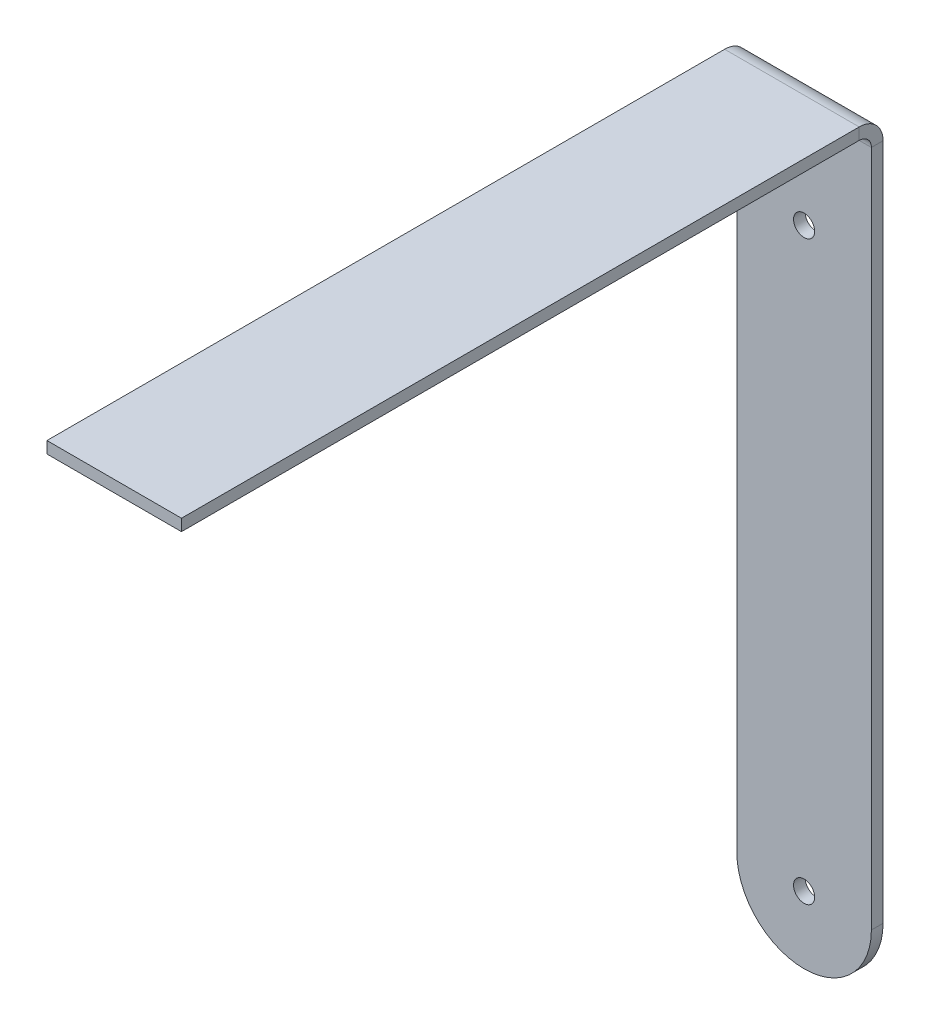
ISO-10303-21;
HEADER;
FILE_DESCRIPTION(('STEP AP214'),'2;1');
FILE_NAME('part.step','',(''),(''),'','','');
FILE_SCHEMA(('AUTOMOTIVE_DESIGN { 1 0 10303 214 1 1 1 1 }'));
ENDSEC;
DATA;
#1=APPLICATION_CONTEXT('core data for automotive mechanical design processes');
#2=APPLICATION_PROTOCOL_DEFINITION('international standard','automotive_design',2000,#1);
#3=PRODUCT_CONTEXT('',#1,'mechanical');
#4=PRODUCT('Part','Part','',(#3));
#5=PRODUCT_RELATED_PRODUCT_CATEGORY('part','',(#4));
#6=PRODUCT_DEFINITION_FORMATION('','',#4);
#7=PRODUCT_DEFINITION_CONTEXT('part definition',#1,'design');
#8=PRODUCT_DEFINITION('design','',#6,#7);
#9=PRODUCT_DEFINITION_SHAPE('','',#8);
#10=(LENGTH_UNIT() NAMED_UNIT(*) SI_UNIT(.MILLI.,.METRE.));
#11=(NAMED_UNIT(*) PLANE_ANGLE_UNIT() SI_UNIT($,.RADIAN.));
#12=(NAMED_UNIT(*) SI_UNIT($,.STERADIAN.) SOLID_ANGLE_UNIT());
#13=UNCERTAINTY_MEASURE_WITH_UNIT(LENGTH_MEASURE(1.E-05),#10,'distance_accuracy_value','');
#14=(GEOMETRIC_REPRESENTATION_CONTEXT(3) GLOBAL_UNCERTAINTY_ASSIGNED_CONTEXT((#13)) GLOBAL_UNIT_ASSIGNED_CONTEXT((#10,
#11,#12)) REPRESENTATION_CONTEXT('',''));
#15=CARTESIAN_POINT('',(0.,0.,0.));
#16=DIRECTION('',(0.,0.,1.));
#17=DIRECTION('',(1.,0.,0.));
#18=AXIS2_PLACEMENT_3D('',#15,#16,#17);
#19=CARTESIAN_POINT('',(17.5,-6.21284,0.));
#20=DIRECTION('',(1.,0.,0.));
#21=DIRECTION('',(0.,0.,-1.));
#22=AXIS2_PLACEMENT_3D('',#19,#20,#21);
#23=PLANE('',#22);
#24=DIRECTION('',(0.,0.,1.));
#25=VECTOR('',#24,1.);
#26=CARTESIAN_POINT('',(17.5,-6.21284,0.));
#27=LINE('',#26,#25);
#28=CARTESIAN_POINT('',(17.5,-6.21284,0.));
#29=VERTEX_POINT('',#28);
#30=CARTESIAN_POINT('',(17.5,-6.21284,3.03784));
#31=VERTEX_POINT('',#30);
#32=EDGE_CURVE('E11',#29,#31,#27,.T.);
#33=ORIENTED_EDGE('',*,*,#32,.F.);
#34=CARTESIAN_POINT('',(17.5,-6.21284,6.21284000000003));
#35=DIRECTION('',(1.,0.,0.));
#36=DIRECTION('',(0.,0.,-1.));
#37=AXIS2_PLACEMENT_3D('',#34,#35,#36);
#38=CIRCLE('',#37,6.21284);
#39=CARTESIAN_POINT('',(17.5,0.,6.21284000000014));
#40=VERTEX_POINT('',#39);
#41=EDGE_CURVE('E129',#40,#29,#38,.F.);
#42=ORIENTED_EDGE('',*,*,#41,.F.);
#43=DIRECTION('',(0.,1.,0.));
#44=VECTOR('',#43,1.);
#45=CARTESIAN_POINT('',(17.5,-3.03784,6.21284000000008));
#46=LINE('',#45,#44);
#47=CARTESIAN_POINT('',(17.5,-3.03784,6.21284000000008));
#48=VERTEX_POINT('',#47);
#49=EDGE_CURVE('E46',#48,#40,#46,.T.);
#50=ORIENTED_EDGE('',*,*,#49,.F.);
#51=CARTESIAN_POINT('',(17.5,-6.21284,6.21284000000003));
#52=DIRECTION('',(1.,0.,0.));
#53=DIRECTION('',(0.,0.,-1.));
#54=AXIS2_PLACEMENT_3D('',#51,#52,#53);
#55=CIRCLE('',#54,3.175);
#56=EDGE_CURVE('E122',#48,#31,#55,.F.);
#57=ORIENTED_EDGE('',*,*,#56,.T.);
#58=EDGE_LOOP('',(#33,#42,#50,#57));
#59=FACE_BOUND('',#58,.T.);
#60=ADVANCED_FACE('F38',(#59),#23,.T.);
#61=CARTESIAN_POINT('',(17.5,-3.03784,6.21284000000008));
#62=DIRECTION('',(1.,0.,0.));
#63=DIRECTION('',(0.,0.,-1.));
#64=AXIS2_PLACEMENT_3D('',#61,#62,#63);
#65=PLANE('',#64);
#66=DIRECTION('',(0.,-1.,0.));
#67=VECTOR('',#66,1.);
#68=CARTESIAN_POINT('',(17.5,0.,0.));
#69=LINE('',#68,#67);
#70=CARTESIAN_POINT('',(17.5,-182.5,0.));
#71=VERTEX_POINT('',#70);
#72=EDGE_CURVE('E173',#29,#71,#69,.T.);
#73=ORIENTED_EDGE('',*,*,#72,.F.);
#74=ORIENTED_EDGE('',*,*,#32,.T.);
#75=DIRECTION('',(0.,-1.,0.));
#76=VECTOR('',#75,1.);
#77=CARTESIAN_POINT('',(17.5,0.,3.03784));
#78=LINE('',#77,#76);
#79=CARTESIAN_POINT('',(17.5,-182.5,3.03783999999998));
#80=VERTEX_POINT('',#79);
#81=EDGE_CURVE('E154',#31,#80,#78,.T.);
#82=ORIENTED_EDGE('',*,*,#81,.T.);
#83=DIRECTION('',(0.,0.,1.));
#84=VECTOR('',#83,1.);
#85=CARTESIAN_POINT('',(17.5,-182.5,0.));
#86=LINE('',#85,#84);
#87=EDGE_CURVE('E374',#71,#80,#86,.T.);
#88=ORIENTED_EDGE('',*,*,#87,.F.);
#89=EDGE_LOOP('',(#73,#74,#82,#88));
#90=FACE_BOUND('',#89,.T.);
#91=ADVANCED_FACE('F181',(#90),#65,.T.);
#92=CARTESIAN_POINT('',(-17.5,0.,6.21284000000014));
#93=DIRECTION('',(-1.,0.,0.));
#94=DIRECTION('',(0.,0.,1.));
#95=AXIS2_PLACEMENT_3D('',#92,#93,#94);
#96=PLANE('',#95);
#97=DIRECTION('',(0.,-1.,0.));
#98=VECTOR('',#97,1.);
#99=CARTESIAN_POINT('',(-17.5,0.,6.21284000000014));
#100=LINE('',#99,#98);
#101=CARTESIAN_POINT('',(-17.5,0.,6.21284000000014));
#102=VERTEX_POINT('',#101);
#103=CARTESIAN_POINT('',(-17.5,-3.03784,6.21284000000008));
#104=VERTEX_POINT('',#103);
#105=EDGE_CURVE('E79',#102,#104,#100,.T.);
#106=ORIENTED_EDGE('',*,*,#105,.F.);
#107=CARTESIAN_POINT('',(-17.5,-6.21284,6.21284000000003));
#108=DIRECTION('',(1.,0.,0.));
#109=DIRECTION('',(0.,0.,-1.));
#110=AXIS2_PLACEMENT_3D('',#107,#108,#109);
#111=CIRCLE('',#110,6.21284);
#112=CARTESIAN_POINT('',(-17.5,-6.21284,0.));
#113=VERTEX_POINT('',#112);
#114=EDGE_CURVE('E145',#102,#113,#111,.F.);
#115=ORIENTED_EDGE('',*,*,#114,.T.);
#116=DIRECTION('',(0.,0.,-1.));
#117=VECTOR('',#116,1.);
#118=CARTESIAN_POINT('',(-17.5,-6.21284,3.03784));
#119=LINE('',#118,#117);
#120=CARTESIAN_POINT('',(-17.5,-6.21284,3.03784));
#121=VERTEX_POINT('',#120);
#122=EDGE_CURVE('E86',#121,#113,#119,.T.);
#123=ORIENTED_EDGE('',*,*,#122,.F.);
#124=CARTESIAN_POINT('',(-17.5,-6.21284,6.21284000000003));
#125=DIRECTION('',(1.,0.,0.));
#126=DIRECTION('',(0.,0.,-1.));
#127=AXIS2_PLACEMENT_3D('',#124,#125,#126);
#128=CIRCLE('',#127,3.175);
#129=EDGE_CURVE('E152',#104,#121,#128,.F.);
#130=ORIENTED_EDGE('',*,*,#129,.F.);
#131=EDGE_LOOP('',(#106,#115,#123,#130));
#132=FACE_BOUND('',#131,.T.);
#133=ADVANCED_FACE('F179',(#132),#96,.T.);
#134=CARTESIAN_POINT('',(-17.5,-6.21284,3.03784));
#135=DIRECTION('',(-1.,0.,0.));
#136=DIRECTION('',(0.,0.,1.));
#137=AXIS2_PLACEMENT_3D('',#134,#135,#136);
#138=PLANE('',#137);
#139=DIRECTION('',(0.,0.,-1.));
#140=VECTOR('',#139,1.);
#141=CARTESIAN_POINT('',(-17.5,0.,182.5));
#142=LINE('',#141,#140);
#143=CARTESIAN_POINT('',(-17.5,0.,182.5));
#144=VERTEX_POINT('',#143);
#145=EDGE_CURVE('E147',#144,#102,#142,.T.);
#146=ORIENTED_EDGE('',*,*,#145,.T.);
#147=ORIENTED_EDGE('',*,*,#105,.T.);
#148=DIRECTION('',(0.,0.,-1.));
#149=VECTOR('',#148,1.);
#150=CARTESIAN_POINT('',(-17.5,-3.03784,182.5));
#151=LINE('',#150,#149);
#152=CARTESIAN_POINT('',(-17.5,-3.03784,182.5));
#153=VERTEX_POINT('',#152);
#154=EDGE_CURVE('E150',#153,#104,#151,.T.);
#155=ORIENTED_EDGE('',*,*,#154,.F.);
#156=DIRECTION('',(0.,1.,0.));
#157=VECTOR('',#156,1.);
#158=CARTESIAN_POINT('',(-17.5,-3.03784,182.5));
#159=LINE('',#158,#157);
#160=EDGE_CURVE('E110',#153,#144,#159,.T.);
#161=ORIENTED_EDGE('',*,*,#160,.T.);
#162=EDGE_LOOP('',(#146,#147,#155,#161));
#163=FACE_BOUND('',#162,.T.);
#164=ADVANCED_FACE('F175',(#163),#138,.T.);
#165=CARTESIAN_POINT('',(17.5,0.,3.03784));
#166=DIRECTION('',(0.,0.,-1.));
#167=DIRECTION('',(0.,1.,0.));
#168=AXIS2_PLACEMENT_3D('',#165,#166,#167);
#169=PLANE('',#168);
#170=CARTESIAN_POINT('',(0.,-182.5,3.03783999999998));
#171=DIRECTION('',(0.,0.,-1.));
#172=DIRECTION('',(0.,1.,0.));
#173=AXIS2_PLACEMENT_3D('',#170,#171,#172);
#174=CIRCLE('',#173,2.75);
#175=CARTESIAN_POINT('',(0.,-179.75,3.03783999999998));
#176=VERTEX_POINT('',#175);
#177=EDGE_CURVE('E356',#176,#176,#174,.T.);
#178=ORIENTED_EDGE('',*,*,#177,.T.);
#179=EDGE_LOOP('',(#178));
#180=FACE_BOUND('',#179,.T.);
#181=CARTESIAN_POINT('',(0.,-32.5,3.03784));
#182=DIRECTION('',(0.,0.,-1.));
#183=DIRECTION('',(0.,1.,0.));
#184=AXIS2_PLACEMENT_3D('',#181,#182,#183);
#185=CIRCLE('',#184,2.75);
#186=CARTESIAN_POINT('',(0.,-29.75,3.03784));
#187=VERTEX_POINT('',#186);
#188=EDGE_CURVE('E366',#187,#187,#185,.T.);
#189=ORIENTED_EDGE('',*,*,#188,.T.);
#190=EDGE_LOOP('',(#189));
#191=FACE_BOUND('',#190,.T.);
#192=DIRECTION('',(0.,-1.,0.));
#193=VECTOR('',#192,1.);
#194=CARTESIAN_POINT('',(-17.5,0.,3.03784));
#195=LINE('',#194,#193);
#196=CARTESIAN_POINT('',(-17.5,-182.5,3.03783999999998));
#197=VERTEX_POINT('',#196);
#198=EDGE_CURVE('E135',#121,#197,#195,.T.);
#199=ORIENTED_EDGE('',*,*,#198,.T.);
#200=CARTESIAN_POINT('',(0.,-182.5,3.03783999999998));
#201=DIRECTION('',(0.,0.,-1.));
#202=DIRECTION('',(0.,1.,0.));
#203=AXIS2_PLACEMENT_3D('',#200,#201,#202);
#204=CIRCLE('',#203,17.5);
#205=EDGE_CURVE('E139',#80,#197,#204,.T.);
#206=ORIENTED_EDGE('',*,*,#205,.F.);
#207=ORIENTED_EDGE('',*,*,#81,.F.);
#208=DIRECTION('',(-1.,0.,0.));
#209=VECTOR('',#208,1.);
#210=CARTESIAN_POINT('',(17.5,-6.21284,3.03784));
#211=LINE('',#210,#209);
#212=EDGE_CURVE('E134',#31,#121,#211,.T.);
#213=ORIENTED_EDGE('',*,*,#212,.T.);
#214=EDGE_LOOP('',(#199,#206,#207,#213));
#215=FACE_BOUND('',#214,.T.);
#216=ADVANCED_FACE('F187',(#180,#191,#215),#169,.F.);
#217=CARTESIAN_POINT('',(17.5,0.,0.));
#218=DIRECTION('',(0.,0.,-1.));
#219=DIRECTION('',(0.,1.,0.));
#220=AXIS2_PLACEMENT_3D('',#217,#218,#219);
#221=PLANE('',#220);
#222=CARTESIAN_POINT('',(0.,-182.5,0.));
#223=DIRECTION('',(0.,0.,-1.));
#224=DIRECTION('',(0.,1.,0.));
#225=AXIS2_PLACEMENT_3D('',#222,#223,#224);
#226=CIRCLE('',#225,2.75);
#227=CARTESIAN_POINT('',(0.,-179.75,0.));
#228=VERTEX_POINT('',#227);
#229=EDGE_CURVE('E359',#228,#228,#226,.T.);
#230=ORIENTED_EDGE('',*,*,#229,.F.);
#231=EDGE_LOOP('',(#230));
#232=FACE_BOUND('',#231,.T.);
#233=CARTESIAN_POINT('',(0.,-32.5,0.));
#234=DIRECTION('',(0.,0.,-1.));
#235=DIRECTION('',(0.,1.,0.));
#236=AXIS2_PLACEMENT_3D('',#233,#234,#235);
#237=CIRCLE('',#236,2.75);
#238=CARTESIAN_POINT('',(0.,-29.75,0.));
#239=VERTEX_POINT('',#238);
#240=EDGE_CURVE('E361',#239,#239,#237,.T.);
#241=ORIENTED_EDGE('',*,*,#240,.F.);
#242=EDGE_LOOP('',(#241));
#243=FACE_BOUND('',#242,.T.);
#244=ORIENTED_EDGE('',*,*,#72,.T.);
#245=CARTESIAN_POINT('',(0.,-182.5,0.));
#246=DIRECTION('',(0.,0.,-1.));
#247=DIRECTION('',(0.,1.,0.));
#248=AXIS2_PLACEMENT_3D('',#245,#246,#247);
#249=CIRCLE('',#248,17.5);
#250=CARTESIAN_POINT('',(-17.5,-182.5,0.));
#251=VERTEX_POINT('',#250);
#252=EDGE_CURVE('E369',#71,#251,#249,.T.);
#253=ORIENTED_EDGE('',*,*,#252,.T.);
#254=DIRECTION('',(0.,-1.,0.));
#255=VECTOR('',#254,1.);
#256=CARTESIAN_POINT('',(-17.5,0.,0.));
#257=LINE('',#256,#255);
#258=EDGE_CURVE('E142',#113,#251,#257,.T.);
#259=ORIENTED_EDGE('',*,*,#258,.F.);
#260=DIRECTION('',(-1.,0.,0.));
#261=VECTOR('',#260,1.);
#262=CARTESIAN_POINT('',(17.5,-6.21284,0.));
#263=LINE('',#262,#261);
#264=EDGE_CURVE('E162',#29,#113,#263,.T.);
#265=ORIENTED_EDGE('',*,*,#264,.F.);
#266=EDGE_LOOP('',(#244,#253,#259,#265));
#267=FACE_BOUND('',#266,.T.);
#268=ADVANCED_FACE('F238',(#232,#243,#267),#221,.T.);
#269=CARTESIAN_POINT('',(17.5,-6.21284,6.21284000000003));
#270=DIRECTION('',(-1.,0.,0.));
#271=DIRECTION('',(0.,0.,1.));
#272=AXIS2_PLACEMENT_3D('',#269,#270,#271);
#273=CYLINDRICAL_SURFACE('',#272,6.21284);
#274=ORIENTED_EDGE('',*,*,#114,.F.);
#275=DIRECTION('',(-1.,0.,0.));
#276=VECTOR('',#275,1.);
#277=CARTESIAN_POINT('',(17.5,0.,6.21284000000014));
#278=LINE('',#277,#276);
#279=EDGE_CURVE('E159',#40,#102,#278,.T.);
#280=ORIENTED_EDGE('',*,*,#279,.F.);
#281=ORIENTED_EDGE('',*,*,#41,.T.);
#282=ORIENTED_EDGE('',*,*,#264,.T.);
#283=EDGE_LOOP('',(#274,#280,#281,#282));
#284=FACE_BOUND('',#283,.T.);
#285=ADVANCED_FACE('F170',(#284),#273,.T.);
#286=CARTESIAN_POINT('',(17.5,0.,182.5));
#287=DIRECTION('',(0.,1.,0.));
#288=DIRECTION('',(0.,0.,1.));
#289=AXIS2_PLACEMENT_3D('',#286,#287,#288);
#290=PLANE('',#289);
#291=ORIENTED_EDGE('',*,*,#145,.F.);
#292=DIRECTION('',(-1.,0.,0.));
#293=VECTOR('',#292,1.);
#294=CARTESIAN_POINT('',(17.5,0.,182.5));
#295=LINE('',#294,#293);
#296=CARTESIAN_POINT('',(17.5,0.,182.5));
#297=VERTEX_POINT('',#296);
#298=EDGE_CURVE('E112',#297,#144,#295,.T.);
#299=ORIENTED_EDGE('',*,*,#298,.F.);
#300=DIRECTION('',(0.,0.,-1.));
#301=VECTOR('',#300,1.);
#302=CARTESIAN_POINT('',(17.5,0.,182.5));
#303=LINE('',#302,#301);
#304=EDGE_CURVE('E127',#297,#40,#303,.T.);
#305=ORIENTED_EDGE('',*,*,#304,.T.);
#306=ORIENTED_EDGE('',*,*,#279,.T.);
#307=EDGE_LOOP('',(#291,#299,#305,#306));
#308=FACE_BOUND('',#307,.T.);
#309=ADVANCED_FACE('F174',(#308),#290,.T.);
#310=CARTESIAN_POINT('',(17.5,-3.03784,182.5));
#311=DIRECTION('',(0.,0.,1.));
#312=DIRECTION('',(1.,0.,0.));
#313=AXIS2_PLACEMENT_3D('',#310,#311,#312);
#314=PLANE('',#313);
#315=ORIENTED_EDGE('',*,*,#160,.F.);
#316=DIRECTION('',(-1.,0.,0.));
#317=VECTOR('',#316,1.);
#318=CARTESIAN_POINT('',(17.5,-3.03784,182.5));
#319=LINE('',#318,#317);
#320=CARTESIAN_POINT('',(17.5,-3.03784,182.5));
#321=VERTEX_POINT('',#320);
#322=EDGE_CURVE('E104',#321,#153,#319,.T.);
#323=ORIENTED_EDGE('',*,*,#322,.F.);
#324=DIRECTION('',(0.,1.,0.));
#325=VECTOR('',#324,1.);
#326=CARTESIAN_POINT('',(17.5,-3.03784,182.5));
#327=LINE('',#326,#325);
#328=EDGE_CURVE('E108',#321,#297,#327,.T.);
#329=ORIENTED_EDGE('',*,*,#328,.T.);
#330=ORIENTED_EDGE('',*,*,#298,.T.);
#331=EDGE_LOOP('',(#315,#323,#329,#330));
#332=FACE_BOUND('',#331,.T.);
#333=ADVANCED_FACE('F106',(#332),#314,.T.);
#334=CARTESIAN_POINT('',(17.5,-3.03784,182.5));
#335=DIRECTION('',(0.,1.,0.));
#336=DIRECTION('',(0.,0.,1.));
#337=AXIS2_PLACEMENT_3D('',#334,#335,#336);
#338=PLANE('',#337);
#339=ORIENTED_EDGE('',*,*,#154,.T.);
#340=DIRECTION('',(-1.,0.,0.));
#341=VECTOR('',#340,1.);
#342=CARTESIAN_POINT('',(17.5,-3.03784,6.21284000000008));
#343=LINE('',#342,#341);
#344=EDGE_CURVE('E113',#48,#104,#343,.T.);
#345=ORIENTED_EDGE('',*,*,#344,.F.);
#346=DIRECTION('',(0.,0.,-1.));
#347=VECTOR('',#346,1.);
#348=CARTESIAN_POINT('',(17.5,-3.03784,182.5));
#349=LINE('',#348,#347);
#350=EDGE_CURVE('E117',#321,#48,#349,.T.);
#351=ORIENTED_EDGE('',*,*,#350,.F.);
#352=ORIENTED_EDGE('',*,*,#322,.T.);
#353=EDGE_LOOP('',(#339,#345,#351,#352));
#354=FACE_BOUND('',#353,.T.);
#355=ADVANCED_FACE('F118',(#354),#338,.F.);
#356=CARTESIAN_POINT('',(17.5,-6.21284,6.21284000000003));
#357=DIRECTION('',(-1.,0.,0.));
#358=DIRECTION('',(0.,0.,1.));
#359=AXIS2_PLACEMENT_3D('',#356,#357,#358);
#360=CYLINDRICAL_SURFACE('',#359,3.175);
#361=ORIENTED_EDGE('',*,*,#129,.T.);
#362=ORIENTED_EDGE('',*,*,#212,.F.);
#363=ORIENTED_EDGE('',*,*,#56,.F.);
#364=ORIENTED_EDGE('',*,*,#344,.T.);
#365=EDGE_LOOP('',(#361,#362,#363,#364));
#366=FACE_BOUND('',#365,.T.);
#367=ADVANCED_FACE('F177',(#366),#360,.F.);
#368=CARTESIAN_POINT('',(17.5,-6.21284,6.21284000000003));
#369=DIRECTION('',(1.,0.,0.));
#370=DIRECTION('',(0.,0.,-1.));
#371=AXIS2_PLACEMENT_3D('',#368,#369,#370);
#372=PLANE('',#371);
#373=ORIENTED_EDGE('',*,*,#350,.T.);
#374=ORIENTED_EDGE('',*,*,#49,.T.);
#375=ORIENTED_EDGE('',*,*,#304,.F.);
#376=ORIENTED_EDGE('',*,*,#328,.F.);
#377=EDGE_LOOP('',(#373,#374,#375,#376));
#378=FACE_BOUND('',#377,.T.);
#379=ADVANCED_FACE('F125',(#378),#372,.T.);
#380=CARTESIAN_POINT('',(-17.5,-6.21284,6.21284000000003));
#381=DIRECTION('',(1.,0.,0.));
#382=DIRECTION('',(0.,0.,-1.));
#383=AXIS2_PLACEMENT_3D('',#380,#381,#382);
#384=PLANE('',#383);
#385=ORIENTED_EDGE('',*,*,#198,.F.);
#386=ORIENTED_EDGE('',*,*,#122,.T.);
#387=ORIENTED_EDGE('',*,*,#258,.T.);
#388=DIRECTION('',(0.,0.,1.));
#389=VECTOR('',#388,1.);
#390=CARTESIAN_POINT('',(-17.5,-182.5,0.));
#391=LINE('',#390,#389);
#392=EDGE_CURVE('E138',#251,#197,#391,.T.);
#393=ORIENTED_EDGE('',*,*,#392,.T.);
#394=EDGE_LOOP('',(#385,#386,#387,#393));
#395=FACE_BOUND('',#394,.T.);
#396=ADVANCED_FACE('F208',(#395),#384,.F.);
#397=CARTESIAN_POINT('',(0.,-182.5,3.03783999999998));
#398=DIRECTION('',(0.,0.,-1.));
#399=DIRECTION('',(0.,1.,0.));
#400=AXIS2_PLACEMENT_3D('',#397,#398,#399);
#401=CYLINDRICAL_SURFACE('',#400,17.5);
#402=ORIENTED_EDGE('',*,*,#252,.F.);
#403=ORIENTED_EDGE('',*,*,#87,.T.);
#404=ORIENTED_EDGE('',*,*,#205,.T.);
#405=ORIENTED_EDGE('',*,*,#392,.F.);
#406=EDGE_LOOP('',(#402,#403,#404,#405));
#407=FACE_BOUND('',#406,.T.);
#408=ADVANCED_FACE('F213',(#407),#401,.T.);
#409=CARTESIAN_POINT('',(0.,-32.5,0.));
#410=DIRECTION('',(0.,0.,-1.));
#411=DIRECTION('',(0.,1.,0.));
#412=AXIS2_PLACEMENT_3D('',#409,#410,#411);
#413=CYLINDRICAL_SURFACE('',#412,2.75);
#414=ORIENTED_EDGE('',*,*,#188,.F.);
#415=EDGE_LOOP('',(#414));
#416=FACE_BOUND('',#415,.T.);
#417=ORIENTED_EDGE('',*,*,#240,.T.);
#418=EDGE_LOOP('',(#417));
#419=FACE_BOUND('',#418,.T.);
#420=ADVANCED_FACE('F225',(#416,#419),#413,.F.);
#421=CARTESIAN_POINT('',(0.,-182.5,0.));
#422=DIRECTION('',(0.,0.,-1.));
#423=DIRECTION('',(0.,1.,0.));
#424=AXIS2_PLACEMENT_3D('',#421,#422,#423);
#425=CYLINDRICAL_SURFACE('',#424,2.75);
#426=ORIENTED_EDGE('',*,*,#177,.F.);
#427=EDGE_LOOP('',(#426));
#428=FACE_BOUND('',#427,.T.);
#429=ORIENTED_EDGE('',*,*,#229,.T.);
#430=EDGE_LOOP('',(#429));
#431=FACE_BOUND('',#430,.T.);
#432=ADVANCED_FACE('F257',(#428,#431),#425,.F.);
#433=CLOSED_SHELL('',(#60,#91,#133,#164,#216,#268,#285,#309,#333,#355,#367,#379,#396,#408,#420,#432));
#434=MANIFOLD_SOLID_BREP('B2',#433);
#435=ADVANCED_BREP_SHAPE_REPRESENTATION('',(#18,#434),#14);
#436=SHAPE_DEFINITION_REPRESENTATION(#9,#435);
ENDSEC;
END-ISO-10303-21;
